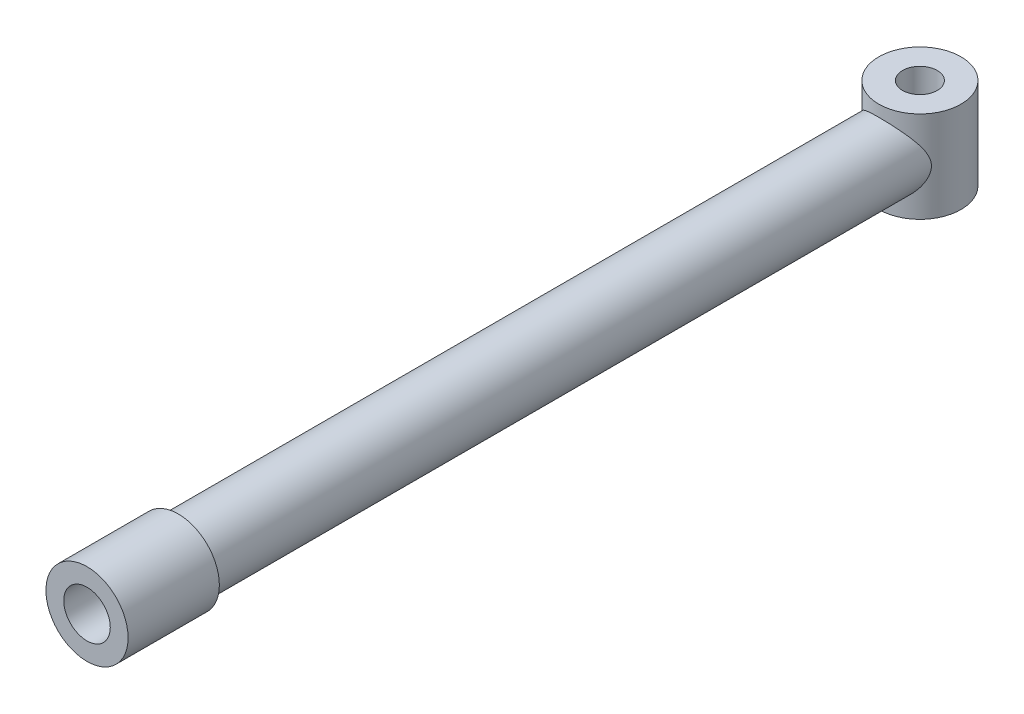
from build123d import *

# Parameters (mm, degrees)
SKETCH1_R           = 75
BOSS_EXTRUDE1_DEPTH = 912.5
SKETCH2_R           = 90
BOSS_EXTRUDE2_DEPTH = 200
SKETCH3_R           = 90
BOSS_EXTRUDE3_DEPTH = 100
SKETCH4_R           = 51
CUT_EXTRUDE1_DEPTH  = 1735
SKETCH5_R           = 38
CUT_EXTRUDE2_DEPTH  = 1027.209652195


with BuildPart() as part:
    # Sketch1 → Boss-Extrude1 (new, symmetric)
    with BuildSketch(Plane.XY):
        with Locations(Location((0, 0, 0), (0, 0, 180))):
            Circle(SKETCH1_R)
    extrude(amount=BOSS_EXTRUDE1_DEPTH, both=True)

    # Sketch2 → Boss-Extrude2 (add)
    with BuildSketch(Plane.XY.offset(912.5)):
        Circle(SKETCH2_R)
    extrude(amount=-BOSS_EXTRUDE2_DEPTH)

    # Sketch3 → Boss-Extrude3 (add, symmetric)
    with BuildSketch(Plane(origin=(0, 0, 0), x_dir=(1, 0, 0), z_dir=(0, 1, 0))):
        with Locations(Location((0, 912.5, 0), (0, 0, 270))):
            Circle(SKETCH3_R)
    extrude(amount=BOSS_EXTRUDE3_DEPTH, both=True)

    # Sketch4 → Cut-Extrude1 (cut)
    with BuildSketch(Plane.XY.offset(912.5)):
        Circle(SKETCH4_R)
    extrude(amount=-CUT_EXTRUDE1_DEPTH, mode=Mode.SUBTRACT)

    # Sketch5 → Cut-Extrude2 (cut, through all)
    with BuildSketch(Plane(origin=(0, 100, 0), x_dir=(1, 0, 0), z_dir=(0, 1, 0))):
        with Locations(Location((0, 912.5, 0), (0, 0, 270))):
            Circle(SKETCH5_R)
    extrude(amount=-CUT_EXTRUDE2_DEPTH, mode=Mode.SUBTRACT)


solid = part.part
